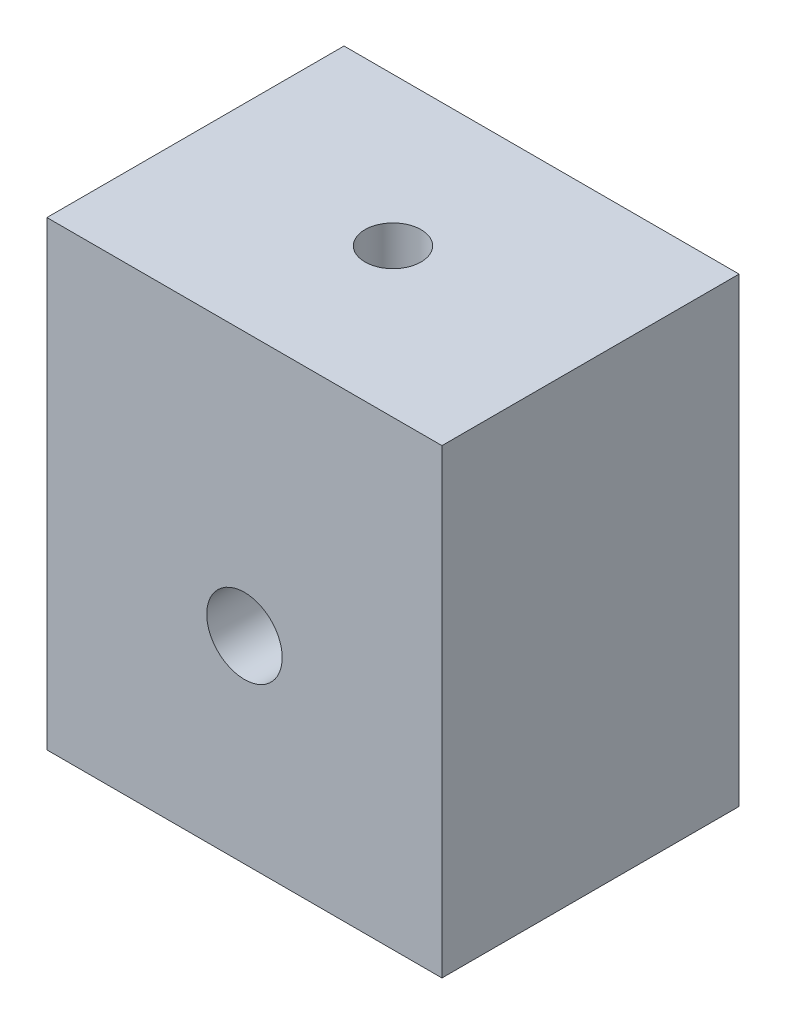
ISO-10303-21;
HEADER;
FILE_DESCRIPTION(('STEP AP214'),'2;1');
FILE_NAME('part.step','',(''),(''),'','','');
FILE_SCHEMA(('AUTOMOTIVE_DESIGN { 1 0 10303 214 1 1 1 1 }'));
ENDSEC;
DATA;
#1=APPLICATION_CONTEXT('core data for automotive mechanical design processes');
#2=APPLICATION_PROTOCOL_DEFINITION('international standard','automotive_design',2000,#1);
#3=PRODUCT_CONTEXT('',#1,'mechanical');
#4=PRODUCT('Part','Part','',(#3));
#5=PRODUCT_RELATED_PRODUCT_CATEGORY('part','',(#4));
#6=PRODUCT_DEFINITION_FORMATION('','',#4);
#7=PRODUCT_DEFINITION_CONTEXT('part definition',#1,'design');
#8=PRODUCT_DEFINITION('design','',#6,#7);
#9=PRODUCT_DEFINITION_SHAPE('','',#8);
#10=(LENGTH_UNIT() NAMED_UNIT(*) SI_UNIT(.MILLI.,.METRE.));
#11=(NAMED_UNIT(*) PLANE_ANGLE_UNIT() SI_UNIT($,.RADIAN.));
#12=(NAMED_UNIT(*) SI_UNIT($,.STERADIAN.) SOLID_ANGLE_UNIT());
#13=UNCERTAINTY_MEASURE_WITH_UNIT(LENGTH_MEASURE(1.E-05),#10,'distance_accuracy_value','');
#14=(GEOMETRIC_REPRESENTATION_CONTEXT(3) GLOBAL_UNCERTAINTY_ASSIGNED_CONTEXT((#13)) GLOBAL_UNIT_ASSIGNED_CONTEXT((#10,
#11,#12)) REPRESENTATION_CONTEXT('',''));
#15=CARTESIAN_POINT('',(0.,0.,0.));
#16=DIRECTION('',(0.,0.,1.));
#17=DIRECTION('',(1.,0.,0.));
#18=AXIS2_PLACEMENT_3D('',#15,#16,#17);
#19=CARTESIAN_POINT('',(0.,7.95,-6.5));
#20=DIRECTION('',(0.,1.,0.));
#21=DIRECTION('',(0.,0.,1.));
#22=AXIS2_PLACEMENT_3D('',#19,#20,#21);
#23=CYLINDRICAL_SURFACE('',#22,2.54);
#24=CARTESIAN_POINT('',(0.,12.95,-6.5));
#25=DIRECTION('',(0.,1.,0.));
#26=DIRECTION('',(0.,0.,1.));
#27=AXIS2_PLACEMENT_3D('',#24,#25,#26);
#28=CIRCLE('',#27,2.54);
#29=CARTESIAN_POINT('',(0.,12.95,-3.96));
#30=VERTEX_POINT('',#29);
#31=EDGE_CURVE('E144',#30,#30,#28,.T.);
#32=ORIENTED_EDGE('',*,*,#31,.F.);
#33=EDGE_LOOP('',(#32));
#34=FACE_BOUND('',#33,.T.);
#35=CARTESIAN_POINT('',(0.,15.95,-6.5));
#36=DIRECTION('',(0.,1.,0.));
#37=DIRECTION('',(0.,0.,1.));
#38=AXIS2_PLACEMENT_3D('',#35,#36,#37);
#39=CIRCLE('',#38,2.54);
#40=CARTESIAN_POINT('',(0.,15.95,-3.96));
#41=VERTEX_POINT('',#40);
#42=EDGE_CURVE('E49',#41,#41,#39,.F.);
#43=ORIENTED_EDGE('',*,*,#42,.F.);
#44=EDGE_LOOP('',(#43));
#45=FACE_BOUND('',#44,.T.);
#46=ADVANCED_FACE('F45',(#34,#45),#23,.F.);
#47=CARTESIAN_POINT('',(17.95,-17.95,-20.));
#48=DIRECTION('',(1.,0.,0.));
#49=DIRECTION('',(0.,0.,-1.));
#50=AXIS2_PLACEMENT_3D('',#47,#48,#49);
#51=PLANE('',#50);
#52=DIRECTION('',(0.,1.,0.));
#53=VECTOR('',#52,1.);
#54=CARTESIAN_POINT('',(17.95,-17.95,-20.));
#55=LINE('',#54,#53);
#56=CARTESIAN_POINT('',(17.95,-17.95,-20.));
#57=VERTEX_POINT('',#56);
#58=CARTESIAN_POINT('',(17.95,23.95,-20.));
#59=VERTEX_POINT('',#58);
#60=EDGE_CURVE('E179',#57,#59,#55,.T.);
#61=ORIENTED_EDGE('',*,*,#60,.T.);
#62=DIRECTION('',(0.,0.,-1.));
#63=VECTOR('',#62,1.);
#64=CARTESIAN_POINT('',(17.95,23.95,-20.));
#65=LINE('',#64,#63);
#66=CARTESIAN_POINT('',(17.95,23.95,7.));
#67=VERTEX_POINT('',#66);
#68=EDGE_CURVE('E129',#67,#59,#65,.T.);
#69=ORIENTED_EDGE('',*,*,#68,.F.);
#70=DIRECTION('',(0.,1.,0.));
#71=VECTOR('',#70,1.);
#72=CARTESIAN_POINT('',(17.95,-17.95,7.));
#73=LINE('',#72,#71);
#74=CARTESIAN_POINT('',(17.95,-17.95,7.));
#75=VERTEX_POINT('',#74);
#76=EDGE_CURVE('E121',#75,#67,#73,.T.);
#77=ORIENTED_EDGE('',*,*,#76,.F.);
#78=DIRECTION('',(0.,0.,1.));
#79=VECTOR('',#78,1.);
#80=CARTESIAN_POINT('',(17.95,-17.95,-20.));
#81=LINE('',#80,#79);
#82=EDGE_CURVE('E11',#57,#75,#81,.T.);
#83=ORIENTED_EDGE('',*,*,#82,.F.);
#84=EDGE_LOOP('',(#61,#69,#77,#83));
#85=FACE_BOUND('',#84,.T.);
#86=ADVANCED_FACE('F47',(#85),#51,.T.);
#87=CARTESIAN_POINT('',(-17.95,-17.95,-20.));
#88=DIRECTION('',(0.,-1.,0.));
#89=DIRECTION('',(0.,0.,-1.));
#90=AXIS2_PLACEMENT_3D('',#87,#88,#89);
#91=PLANE('',#90);
#92=ORIENTED_EDGE('',*,*,#82,.T.);
#93=DIRECTION('',(1.,0.,0.));
#94=VECTOR('',#93,1.);
#95=CARTESIAN_POINT('',(-17.95,-17.95,7.));
#96=LINE('',#95,#94);
#97=CARTESIAN_POINT('',(-17.95,-17.95,7.));
#98=VERTEX_POINT('',#97);
#99=EDGE_CURVE('E120',#98,#75,#96,.T.);
#100=ORIENTED_EDGE('',*,*,#99,.F.);
#101=DIRECTION('',(0.,0.,1.));
#102=VECTOR('',#101,1.);
#103=CARTESIAN_POINT('',(-17.95,-17.95,-20.));
#104=LINE('',#103,#102);
#105=CARTESIAN_POINT('',(-17.95,-17.95,-20.));
#106=VERTEX_POINT('',#105);
#107=EDGE_CURVE('E54',#106,#98,#104,.T.);
#108=ORIENTED_EDGE('',*,*,#107,.F.);
#109=DIRECTION('',(1.,0.,0.));
#110=VECTOR('',#109,1.);
#111=CARTESIAN_POINT('',(-17.95,-17.95,-20.));
#112=LINE('',#111,#110);
#113=EDGE_CURVE('E190',#106,#57,#112,.T.);
#114=ORIENTED_EDGE('',*,*,#113,.T.);
#115=EDGE_LOOP('',(#92,#100,#108,#114));
#116=FACE_BOUND('',#115,.T.);
#117=ADVANCED_FACE('F248',(#116),#91,.T.);
#118=CARTESIAN_POINT('',(-17.95,-17.95,-20.));
#119=DIRECTION('',(-1.,0.,0.));
#120=DIRECTION('',(0.,0.,1.));
#121=AXIS2_PLACEMENT_3D('',#118,#119,#120);
#122=PLANE('',#121);
#123=ORIENTED_EDGE('',*,*,#107,.T.);
#124=DIRECTION('',(0.,-1.,0.));
#125=VECTOR('',#124,1.);
#126=CARTESIAN_POINT('',(-17.95,-17.95,7.));
#127=LINE('',#126,#125);
#128=CARTESIAN_POINT('',(-17.95,23.95,7.));
#129=VERTEX_POINT('',#128);
#130=EDGE_CURVE('E111',#129,#98,#127,.T.);
#131=ORIENTED_EDGE('',*,*,#130,.F.);
#132=DIRECTION('',(0.,0.,1.));
#133=VECTOR('',#132,1.);
#134=CARTESIAN_POINT('',(-17.95,23.95,-20.));
#135=LINE('',#134,#133);
#136=CARTESIAN_POINT('',(-17.95,23.95,-20.));
#137=VERTEX_POINT('',#136);
#138=EDGE_CURVE('E116',#137,#129,#135,.T.);
#139=ORIENTED_EDGE('',*,*,#138,.F.);
#140=DIRECTION('',(0.,-1.,0.));
#141=VECTOR('',#140,1.);
#142=CARTESIAN_POINT('',(-17.95,-17.95,-20.));
#143=LINE('',#142,#141);
#144=EDGE_CURVE('E188',#137,#106,#143,.T.);
#145=ORIENTED_EDGE('',*,*,#144,.T.);
#146=EDGE_LOOP('',(#123,#131,#139,#145));
#147=FACE_BOUND('',#146,.T.);
#148=ADVANCED_FACE('F113',(#147),#122,.T.);
#149=CARTESIAN_POINT('',(0.,0.,-20.));
#150=DIRECTION('',(0.,0.,-1.));
#151=DIRECTION('',(-1.,0.,0.));
#152=AXIS2_PLACEMENT_3D('',#149,#150,#151);
#153=PLANE('',#152);
#154=DIRECTION('',(0.,1.,0.));
#155=VECTOR('',#154,1.);
#156=CARTESIAN_POINT('',(12.95,-12.95,-20.));
#157=LINE('',#156,#155);
#158=CARTESIAN_POINT('',(12.95,-12.95,-20.));
#159=VERTEX_POINT('',#158);
#160=CARTESIAN_POINT('',(12.95,12.95,-20.));
#161=VERTEX_POINT('',#160);
#162=EDGE_CURVE('E154',#159,#161,#157,.T.);
#163=ORIENTED_EDGE('',*,*,#162,.T.);
#164=DIRECTION('',(-1.,0.,0.));
#165=VECTOR('',#164,1.);
#166=CARTESIAN_POINT('',(-12.95,12.95,-20.));
#167=LINE('',#166,#165);
#168=CARTESIAN_POINT('',(-12.95,12.95,-20.));
#169=VERTEX_POINT('',#168);
#170=EDGE_CURVE('E157',#161,#169,#167,.T.);
#171=ORIENTED_EDGE('',*,*,#170,.T.);
#172=DIRECTION('',(0.,-1.,0.));
#173=VECTOR('',#172,1.);
#174=CARTESIAN_POINT('',(-12.95,-12.95,-20.));
#175=LINE('',#174,#173);
#176=CARTESIAN_POINT('',(-12.95,-12.95,-20.));
#177=VERTEX_POINT('',#176);
#178=EDGE_CURVE('E62',#169,#177,#175,.T.);
#179=ORIENTED_EDGE('',*,*,#178,.T.);
#180=DIRECTION('',(1.,0.,0.));
#181=VECTOR('',#180,1.);
#182=CARTESIAN_POINT('',(-12.95,-12.95,-20.));
#183=LINE('',#182,#181);
#184=EDGE_CURVE('E162',#177,#159,#183,.T.);
#185=ORIENTED_EDGE('',*,*,#184,.T.);
#186=EDGE_LOOP('',(#163,#171,#179,#185));
#187=FACE_BOUND('',#186,.T.);
#188=ORIENTED_EDGE('',*,*,#60,.F.);
#189=ORIENTED_EDGE('',*,*,#113,.F.);
#190=ORIENTED_EDGE('',*,*,#144,.F.);
#191=DIRECTION('',(-1.,0.,0.));
#192=VECTOR('',#191,1.);
#193=CARTESIAN_POINT('',(-17.95,23.95,-20.));
#194=LINE('',#193,#192);
#195=EDGE_CURVE('E134',#59,#137,#194,.T.);
#196=ORIENTED_EDGE('',*,*,#195,.F.);
#197=EDGE_LOOP('',(#188,#189,#190,#196));
#198=FACE_BOUND('',#197,.T.);
#199=ADVANCED_FACE('F243',(#187,#198),#153,.T.);
#200=CARTESIAN_POINT('',(12.95,-12.95,-20.));
#201=DIRECTION('',(1.,0.,0.));
#202=DIRECTION('',(0.,0.,-1.));
#203=AXIS2_PLACEMENT_3D('',#200,#201,#202);
#204=PLANE('',#203);
#205=DIRECTION('',(0.,1.,0.));
#206=VECTOR('',#205,1.);
#207=CARTESIAN_POINT('',(12.95,-12.95,0.));
#208=LINE('',#207,#206);
#209=CARTESIAN_POINT('',(12.95,-12.95,0.));
#210=VERTEX_POINT('',#209);
#211=CARTESIAN_POINT('',(12.95,12.95,0.));
#212=VERTEX_POINT('',#211);
#213=EDGE_CURVE('E153',#210,#212,#208,.T.);
#214=ORIENTED_EDGE('',*,*,#213,.T.);
#215=DIRECTION('',(0.,0.,1.));
#216=VECTOR('',#215,1.);
#217=CARTESIAN_POINT('',(12.95,12.95,-20.));
#218=LINE('',#217,#216);
#219=EDGE_CURVE('E165',#161,#212,#218,.T.);
#220=ORIENTED_EDGE('',*,*,#219,.F.);
#221=ORIENTED_EDGE('',*,*,#162,.F.);
#222=DIRECTION('',(0.,0.,1.));
#223=VECTOR('',#222,1.);
#224=CARTESIAN_POINT('',(12.95,-12.95,-20.));
#225=LINE('',#224,#223);
#226=EDGE_CURVE('E176',#159,#210,#225,.T.);
#227=ORIENTED_EDGE('',*,*,#226,.T.);
#228=EDGE_LOOP('',(#214,#220,#221,#227));
#229=FACE_BOUND('',#228,.T.);
#230=ADVANCED_FACE('F235',(#229),#204,.F.);
#231=CARTESIAN_POINT('',(-12.95,-12.95,-20.));
#232=DIRECTION('',(0.,-1.,0.));
#233=DIRECTION('',(0.,0.,-1.));
#234=AXIS2_PLACEMENT_3D('',#231,#232,#233);
#235=PLANE('',#234);
#236=DIRECTION('',(1.,0.,0.));
#237=VECTOR('',#236,1.);
#238=CARTESIAN_POINT('',(-12.95,-12.95,0.));
#239=LINE('',#238,#237);
#240=CARTESIAN_POINT('',(-12.95,-12.95,0.));
#241=VERTEX_POINT('',#240);
#242=EDGE_CURVE('E158',#241,#210,#239,.T.);
#243=ORIENTED_EDGE('',*,*,#242,.T.);
#244=ORIENTED_EDGE('',*,*,#226,.F.);
#245=ORIENTED_EDGE('',*,*,#184,.F.);
#246=DIRECTION('',(0.,0.,1.));
#247=VECTOR('',#246,1.);
#248=CARTESIAN_POINT('',(-12.95,-12.95,-20.));
#249=LINE('',#248,#247);
#250=EDGE_CURVE('E180',#177,#241,#249,.T.);
#251=ORIENTED_EDGE('',*,*,#250,.T.);
#252=EDGE_LOOP('',(#243,#244,#245,#251));
#253=FACE_BOUND('',#252,.T.);
#254=ADVANCED_FACE('F231',(#253),#235,.F.);
#255=CARTESIAN_POINT('',(-12.95,-12.95,-20.));
#256=DIRECTION('',(-1.,0.,0.));
#257=DIRECTION('',(0.,0.,1.));
#258=AXIS2_PLACEMENT_3D('',#255,#256,#257);
#259=PLANE('',#258);
#260=DIRECTION('',(0.,-1.,0.));
#261=VECTOR('',#260,1.);
#262=CARTESIAN_POINT('',(-12.95,-12.95,0.));
#263=LINE('',#262,#261);
#264=CARTESIAN_POINT('',(-12.95,12.95,0.));
#265=VERTEX_POINT('',#264);
#266=EDGE_CURVE('E171',#265,#241,#263,.T.);
#267=ORIENTED_EDGE('',*,*,#266,.T.);
#268=ORIENTED_EDGE('',*,*,#250,.F.);
#269=ORIENTED_EDGE('',*,*,#178,.F.);
#270=DIRECTION('',(0.,0.,1.));
#271=VECTOR('',#270,1.);
#272=CARTESIAN_POINT('',(-12.95,12.95,-20.));
#273=LINE('',#272,#271);
#274=EDGE_CURVE('E183',#169,#265,#273,.T.);
#275=ORIENTED_EDGE('',*,*,#274,.T.);
#276=EDGE_LOOP('',(#267,#268,#269,#275));
#277=FACE_BOUND('',#276,.T.);
#278=ADVANCED_FACE('F234',(#277),#259,.F.);
#279=CARTESIAN_POINT('',(-12.95,12.95,-20.));
#280=DIRECTION('',(0.,1.,0.));
#281=DIRECTION('',(0.,0.,1.));
#282=AXIS2_PLACEMENT_3D('',#279,#280,#281);
#283=PLANE('',#282);
#284=ORIENTED_EDGE('',*,*,#31,.T.);
#285=EDGE_LOOP('',(#284));
#286=FACE_BOUND('',#285,.T.);
#287=DIRECTION('',(-1.,0.,0.));
#288=VECTOR('',#287,1.);
#289=CARTESIAN_POINT('',(-12.95,12.95,0.));
#290=LINE('',#289,#288);
#291=EDGE_CURVE('E168',#212,#265,#290,.T.);
#292=ORIENTED_EDGE('',*,*,#291,.T.);
#293=ORIENTED_EDGE('',*,*,#274,.F.);
#294=ORIENTED_EDGE('',*,*,#170,.F.);
#295=ORIENTED_EDGE('',*,*,#219,.T.);
#296=EDGE_LOOP('',(#292,#293,#294,#295));
#297=FACE_BOUND('',#296,.T.);
#298=ADVANCED_FACE('F196',(#286,#297),#283,.F.);
#299=CARTESIAN_POINT('',(0.,0.,0.));
#300=DIRECTION('',(0.,0.,-1.));
#301=DIRECTION('',(-1.,0.,0.));
#302=AXIS2_PLACEMENT_3D('',#299,#300,#301);
#303=PLANE('',#302);
#304=CARTESIAN_POINT('',(0.,0.,0.));
#305=DIRECTION('',(0.,0.,-1.));
#306=DIRECTION('',(-1.,0.,0.));
#307=AXIS2_PLACEMENT_3D('',#304,#305,#306);
#308=CIRCLE('',#307,3.43);
#309=CARTESIAN_POINT('',(-3.43,0.,0.));
#310=VERTEX_POINT('',#309);
#311=EDGE_CURVE('E148',#310,#310,#308,.T.);
#312=ORIENTED_EDGE('',*,*,#311,.F.);
#313=EDGE_LOOP('',(#312));
#314=FACE_BOUND('',#313,.T.);
#315=ORIENTED_EDGE('',*,*,#291,.F.);
#316=ORIENTED_EDGE('',*,*,#213,.F.);
#317=ORIENTED_EDGE('',*,*,#242,.F.);
#318=ORIENTED_EDGE('',*,*,#266,.F.);
#319=EDGE_LOOP('',(#315,#316,#317,#318));
#320=FACE_BOUND('',#319,.T.);
#321=ADVANCED_FACE('F226',(#314,#320),#303,.T.);
#322=CARTESIAN_POINT('',(0.,0.,7.));
#323=DIRECTION('',(0.,0.,-1.));
#324=DIRECTION('',(-1.,0.,0.));
#325=AXIS2_PLACEMENT_3D('',#322,#323,#324);
#326=PLANE('',#325);
#327=CARTESIAN_POINT('',(0.,0.,7.));
#328=DIRECTION('',(0.,0.,1.));
#329=DIRECTION('',(1.,0.,0.));
#330=AXIS2_PLACEMENT_3D('',#327,#328,#329);
#331=CIRCLE('',#330,3.43);
#332=CARTESIAN_POINT('',(3.43,0.,7.));
#333=VERTEX_POINT('',#332);
#334=EDGE_CURVE('E145',#333,#333,#331,.T.);
#335=ORIENTED_EDGE('',*,*,#334,.F.);
#336=EDGE_LOOP('',(#335));
#337=FACE_BOUND('',#336,.T.);
#338=ORIENTED_EDGE('',*,*,#76,.T.);
#339=DIRECTION('',(1.,0.,0.));
#340=VECTOR('',#339,1.);
#341=CARTESIAN_POINT('',(-17.95,23.95,7.));
#342=LINE('',#341,#340);
#343=EDGE_CURVE('E124',#129,#67,#342,.T.);
#344=ORIENTED_EDGE('',*,*,#343,.F.);
#345=ORIENTED_EDGE('',*,*,#130,.T.);
#346=ORIENTED_EDGE('',*,*,#99,.T.);
#347=EDGE_LOOP('',(#338,#344,#345,#346));
#348=FACE_BOUND('',#347,.T.);
#349=ADVANCED_FACE('F125',(#337,#348),#326,.F.);
#350=CARTESIAN_POINT('',(0.,0.,-3.));
#351=DIRECTION('',(0.,0.,1.));
#352=DIRECTION('',(1.,0.,0.));
#353=AXIS2_PLACEMENT_3D('',#350,#351,#352);
#354=CYLINDRICAL_SURFACE('',#353,3.43);
#355=ORIENTED_EDGE('',*,*,#311,.T.);
#356=EDGE_LOOP('',(#355));
#357=FACE_BOUND('',#356,.T.);
#358=ORIENTED_EDGE('',*,*,#334,.T.);
#359=EDGE_LOOP('',(#358));
#360=FACE_BOUND('',#359,.T.);
#361=ADVANCED_FACE('F216',(#357,#360),#354,.F.);
#362=CARTESIAN_POINT('',(0.,23.95,0.));
#363=DIRECTION('',(0.,1.,0.));
#364=DIRECTION('',(0.,0.,1.));
#365=AXIS2_PLACEMENT_3D('',#362,#363,#364);
#366=PLANE('',#365);
#367=CARTESIAN_POINT('',(0.,23.95,-6.5));
#368=DIRECTION('',(0.,1.,0.));
#369=DIRECTION('',(0.,0.,1.));
#370=AXIS2_PLACEMENT_3D('',#367,#368,#369);
#371=CIRCLE('',#370,2.55);
#372=CARTESIAN_POINT('',(0.,23.95,-3.95));
#373=VERTEX_POINT('',#372);
#374=EDGE_CURVE('E139',#373,#373,#371,.T.);
#375=ORIENTED_EDGE('',*,*,#374,.F.);
#376=EDGE_LOOP('',(#375));
#377=FACE_BOUND('',#376,.T.);
#378=ORIENTED_EDGE('',*,*,#138,.T.);
#379=ORIENTED_EDGE('',*,*,#343,.T.);
#380=ORIENTED_EDGE('',*,*,#68,.T.);
#381=ORIENTED_EDGE('',*,*,#195,.T.);
#382=EDGE_LOOP('',(#378,#379,#380,#381));
#383=FACE_BOUND('',#382,.T.);
#384=ADVANCED_FACE('F132',(#377,#383),#366,.T.);
#385=CARTESIAN_POINT('',(0.,15.95,-6.5));
#386=DIRECTION('',(0.,1.,0.));
#387=DIRECTION('',(0.,0.,1.));
#388=AXIS2_PLACEMENT_3D('',#385,#386,#387);
#389=PLANE('',#388);
#390=CARTESIAN_POINT('',(0.,15.95,-6.5));
#391=DIRECTION('',(0.,1.,0.));
#392=DIRECTION('',(0.,0.,1.));
#393=AXIS2_PLACEMENT_3D('',#390,#391,#392);
#394=CIRCLE('',#393,2.55);
#395=CARTESIAN_POINT('',(0.,15.95,-3.95));
#396=VERTEX_POINT('',#395);
#397=EDGE_CURVE('E137',#396,#396,#394,.T.);
#398=ORIENTED_EDGE('',*,*,#397,.T.);
#399=EDGE_LOOP('',(#398));
#400=FACE_BOUND('',#399,.T.);
#401=ORIENTED_EDGE('',*,*,#42,.T.);
#402=EDGE_LOOP('',(#401));
#403=FACE_BOUND('',#402,.T.);
#404=ADVANCED_FACE('F204',(#400,#403),#389,.T.);
#405=CARTESIAN_POINT('',(0.,15.95,-6.5));
#406=DIRECTION('',(0.,1.,0.));
#407=DIRECTION('',(0.,0.,1.));
#408=AXIS2_PLACEMENT_3D('',#405,#406,#407);
#409=CYLINDRICAL_SURFACE('',#408,2.55);
#410=ORIENTED_EDGE('',*,*,#397,.F.);
#411=EDGE_LOOP('',(#410));
#412=FACE_BOUND('',#411,.T.);
#413=ORIENTED_EDGE('',*,*,#374,.T.);
#414=EDGE_LOOP('',(#413));
#415=FACE_BOUND('',#414,.T.);
#416=ADVANCED_FACE('F206',(#412,#415),#409,.F.);
#417=CLOSED_SHELL('',(#46,#86,#117,#148,#199,#230,#254,#278,#298,#321,#349,#361,#384,#404,#416));
#418=MANIFOLD_SOLID_BREP('B2',#417);
#419=ADVANCED_BREP_SHAPE_REPRESENTATION('',(#18,#418),#14);
#420=SHAPE_DEFINITION_REPRESENTATION(#9,#419);
ENDSEC;
END-ISO-10303-21;
